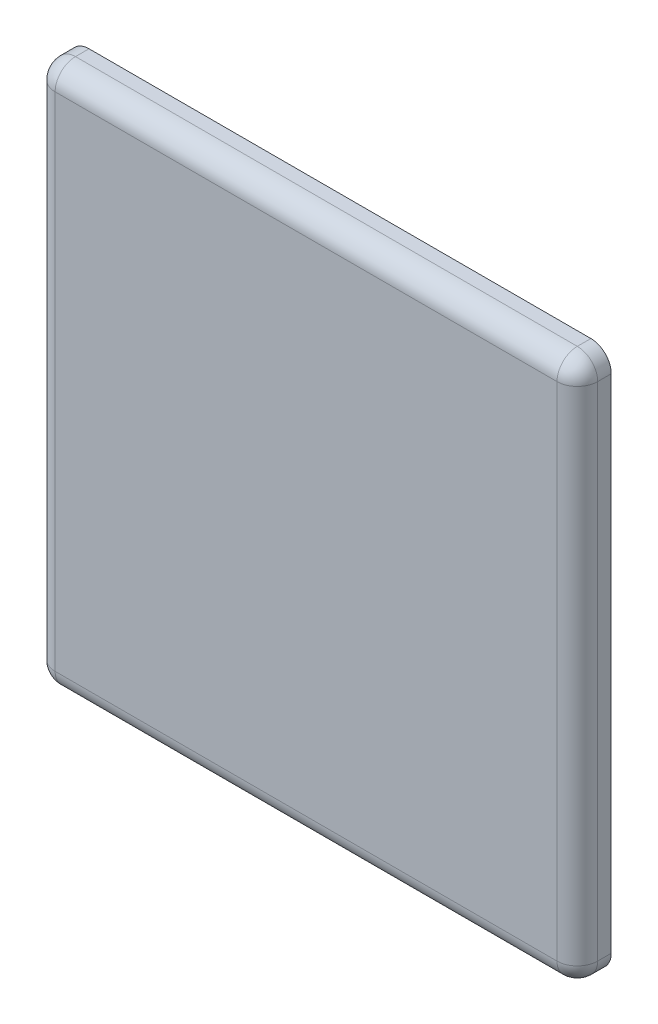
ISO-10303-21;
HEADER;
FILE_DESCRIPTION(('STEP AP214'),'2;1');
FILE_NAME('part.step','',(''),(''),'','','');
FILE_SCHEMA(('AUTOMOTIVE_DESIGN { 1 0 10303 214 1 1 1 1 }'));
ENDSEC;
DATA;
#1=APPLICATION_CONTEXT('core data for automotive mechanical design processes');
#2=APPLICATION_PROTOCOL_DEFINITION('international standard','automotive_design',2000,#1);
#3=PRODUCT_CONTEXT('',#1,'mechanical');
#4=PRODUCT('Part','Part','',(#3));
#5=PRODUCT_RELATED_PRODUCT_CATEGORY('part','',(#4));
#6=PRODUCT_DEFINITION_FORMATION('','',#4);
#7=PRODUCT_DEFINITION_CONTEXT('part definition',#1,'design');
#8=PRODUCT_DEFINITION('design','',#6,#7);
#9=PRODUCT_DEFINITION_SHAPE('','',#8);
#10=(LENGTH_UNIT() NAMED_UNIT(*) SI_UNIT(.MILLI.,.METRE.));
#11=(NAMED_UNIT(*) PLANE_ANGLE_UNIT() SI_UNIT($,.RADIAN.));
#12=(NAMED_UNIT(*) SI_UNIT($,.STERADIAN.) SOLID_ANGLE_UNIT());
#13=UNCERTAINTY_MEASURE_WITH_UNIT(LENGTH_MEASURE(1.E-05),#10,'distance_accuracy_value','');
#14=(GEOMETRIC_REPRESENTATION_CONTEXT(3) GLOBAL_UNCERTAINTY_ASSIGNED_CONTEXT((#13)) GLOBAL_UNIT_ASSIGNED_CONTEXT((#10,
#11,#12)) REPRESENTATION_CONTEXT('',''));
#15=CARTESIAN_POINT('',(0.,0.,0.));
#16=DIRECTION('',(0.,0.,1.));
#17=DIRECTION('',(1.,0.,0.));
#18=AXIS2_PLACEMENT_3D('',#15,#16,#17);
#19=CARTESIAN_POINT('',(1.5,38.5,1.));
#20=DIRECTION('',(0.,0.,1.));
#21=DIRECTION('',(0.,1.,0.));
#22=AXIS2_PLACEMENT_3D('',#19,#20,#21);
#23=SPHERICAL_SURFACE('',#22,1.5);
#24=CARTESIAN_POINT('',(1.5,38.5,1.));
#25=DIRECTION('',(-1.,0.,0.));
#26=DIRECTION('',(0.,0.,1.));
#27=AXIS2_PLACEMENT_3D('',#24,#25,#26);
#28=CIRCLE('',#27,1.5);
#29=CARTESIAN_POINT('',(1.5,40.,1.));
#30=VERTEX_POINT('',#29);
#31=CARTESIAN_POINT('',(1.5,38.5,2.5));
#32=VERTEX_POINT('',#31);
#33=EDGE_CURVE('E20',#30,#32,#28,.F.);
#34=ORIENTED_EDGE('',*,*,#33,.F.);
#35=CARTESIAN_POINT('',(1.5,38.5,1.));
#36=DIRECTION('',(0.,0.,-1.));
#37=DIRECTION('',(-1.,0.,0.));
#38=AXIS2_PLACEMENT_3D('',#35,#36,#37);
#39=CIRCLE('',#38,1.5);
#40=CARTESIAN_POINT('',(0.,38.5,1.));
#41=VERTEX_POINT('',#40);
#42=EDGE_CURVE('E93',#41,#30,#39,.T.);
#43=ORIENTED_EDGE('',*,*,#42,.F.);
#44=CARTESIAN_POINT('',(1.5,38.5,1.));
#45=DIRECTION('',(0.,-1.,0.));
#46=DIRECTION('',(0.,0.,-1.));
#47=AXIS2_PLACEMENT_3D('',#44,#45,#46);
#48=CIRCLE('',#47,1.5);
#49=EDGE_CURVE('E95',#32,#41,#48,.T.);
#50=ORIENTED_EDGE('',*,*,#49,.F.);
#51=EDGE_LOOP('',(#34,#43,#50));
#52=FACE_BOUND('',#51,.T.);
#53=ADVANCED_FACE('F16',(#52),#23,.T.);
#54=CARTESIAN_POINT('',(38.5,38.5,1.));
#55=DIRECTION('',(-1.,0.,0.));
#56=DIRECTION('',(0.,0.,1.));
#57=AXIS2_PLACEMENT_3D('',#54,#55,#56);
#58=CYLINDRICAL_SURFACE('',#57,1.5);
#59=CARTESIAN_POINT('',(38.5,38.5,1.));
#60=DIRECTION('',(1.,0.,0.));
#61=DIRECTION('',(0.,1.,0.));
#62=AXIS2_PLACEMENT_3D('',#59,#60,#61);
#63=CIRCLE('',#62,1.5);
#64=CARTESIAN_POINT('',(38.5,40.,1.));
#65=VERTEX_POINT('',#64);
#66=CARTESIAN_POINT('',(38.5,38.5,2.5));
#67=VERTEX_POINT('',#66);
#68=EDGE_CURVE('E111',#65,#67,#63,.T.);
#69=ORIENTED_EDGE('',*,*,#68,.F.);
#70=DIRECTION('',(1.,0.,0.));
#71=VECTOR('',#70,1.);
#72=CARTESIAN_POINT('',(20.,40.,1.));
#73=LINE('',#72,#71);
#74=EDGE_CURVE('E108',#30,#65,#73,.T.);
#75=ORIENTED_EDGE('',*,*,#74,.F.);
#76=ORIENTED_EDGE('',*,*,#33,.T.);
#77=DIRECTION('',(-1.,0.,0.));
#78=VECTOR('',#77,1.);
#79=CARTESIAN_POINT('',(20.,38.5,2.5));
#80=LINE('',#79,#78);
#81=EDGE_CURVE('E170',#67,#32,#80,.T.);
#82=ORIENTED_EDGE('',*,*,#81,.F.);
#83=EDGE_LOOP('',(#69,#75,#76,#82));
#84=FACE_BOUND('',#83,.T.);
#85=ADVANCED_FACE('F109',(#84),#58,.T.);
#86=CARTESIAN_POINT('',(1.5,38.5,1.));
#87=DIRECTION('',(0.,-1.,0.));
#88=DIRECTION('',(0.,0.,-1.));
#89=AXIS2_PLACEMENT_3D('',#86,#87,#88);
#90=CYLINDRICAL_SURFACE('',#89,1.5);
#91=CARTESIAN_POINT('',(1.5,1.5,1.));
#92=DIRECTION('',(0.,1.,0.));
#93=DIRECTION('',(0.,0.,1.));
#94=AXIS2_PLACEMENT_3D('',#91,#92,#93);
#95=CIRCLE('',#94,1.5);
#96=CARTESIAN_POINT('',(1.5,1.5,2.5));
#97=VERTEX_POINT('',#96);
#98=CARTESIAN_POINT('',(0.,1.5,1.));
#99=VERTEX_POINT('',#98);
#100=EDGE_CURVE('E163',#97,#99,#95,.F.);
#101=ORIENTED_EDGE('',*,*,#100,.F.);
#102=DIRECTION('',(0.,-1.,0.));
#103=VECTOR('',#102,1.);
#104=CARTESIAN_POINT('',(1.5,20.,2.5));
#105=LINE('',#104,#103);
#106=EDGE_CURVE('E166',#32,#97,#105,.T.);
#107=ORIENTED_EDGE('',*,*,#106,.F.);
#108=ORIENTED_EDGE('',*,*,#49,.T.);
#109=DIRECTION('',(0.,1.,0.));
#110=VECTOR('',#109,1.);
#111=CARTESIAN_POINT('',(0.,20.,1.));
#112=LINE('',#111,#110);
#113=EDGE_CURVE('E127',#99,#41,#112,.T.);
#114=ORIENTED_EDGE('',*,*,#113,.F.);
#115=EDGE_LOOP('',(#101,#107,#108,#114));
#116=FACE_BOUND('',#115,.T.);
#117=ADVANCED_FACE('F172',(#116),#90,.T.);
#118=CARTESIAN_POINT('',(1.5,1.5,1.));
#119=DIRECTION('',(0.,0.,-1.));
#120=DIRECTION('',(-1.,0.,0.));
#121=AXIS2_PLACEMENT_3D('',#118,#119,#120);
#122=CYLINDRICAL_SURFACE('',#121,1.5);
#123=DIRECTION('',(0.,0.,1.));
#124=VECTOR('',#123,1.);
#125=CARTESIAN_POINT('',(0.,1.5,0.5));
#126=LINE('',#125,#124);
#127=CARTESIAN_POINT('',(0.,1.5,0.));
#128=VERTEX_POINT('',#127);
#129=EDGE_CURVE('E125',#128,#99,#126,.T.);
#130=ORIENTED_EDGE('',*,*,#129,.F.);
#131=CARTESIAN_POINT('',(1.5,1.5,0.));
#132=DIRECTION('',(0.,0.,-1.));
#133=DIRECTION('',(-1.,0.,0.));
#134=AXIS2_PLACEMENT_3D('',#131,#132,#133);
#135=CIRCLE('',#134,1.5);
#136=CARTESIAN_POINT('',(1.5,0.,0.));
#137=VERTEX_POINT('',#136);
#138=EDGE_CURVE('E156',#137,#128,#135,.T.);
#139=ORIENTED_EDGE('',*,*,#138,.F.);
#140=DIRECTION('',(0.,0.,-1.));
#141=VECTOR('',#140,1.);
#142=CARTESIAN_POINT('',(1.5,0.,0.5));
#143=LINE('',#142,#141);
#144=CARTESIAN_POINT('',(1.5,0.,1.));
#145=VERTEX_POINT('',#144);
#146=EDGE_CURVE('E184',#145,#137,#143,.T.);
#147=ORIENTED_EDGE('',*,*,#146,.F.);
#148=CARTESIAN_POINT('',(1.5,1.5,1.));
#149=DIRECTION('',(0.,0.,1.));
#150=DIRECTION('',(1.,0.,0.));
#151=AXIS2_PLACEMENT_3D('',#148,#149,#150);
#152=CIRCLE('',#151,1.5);
#153=EDGE_CURVE('E160',#99,#145,#152,.T.);
#154=ORIENTED_EDGE('',*,*,#153,.F.);
#155=EDGE_LOOP('',(#130,#139,#147,#154));
#156=FACE_BOUND('',#155,.T.);
#157=ADVANCED_FACE('F182',(#156),#122,.T.);
#158=CARTESIAN_POINT('',(0.,1.5,0.));
#159=DIRECTION('',(-1.,0.,0.));
#160=DIRECTION('',(0.,0.,1.));
#161=AXIS2_PLACEMENT_3D('',#158,#159,#160);
#162=PLANE('',#161);
#163=ORIENTED_EDGE('',*,*,#129,.T.);
#164=ORIENTED_EDGE('',*,*,#113,.T.);
#165=DIRECTION('',(0.,0.,1.));
#166=VECTOR('',#165,1.);
#167=CARTESIAN_POINT('',(0.,38.5,0.5));
#168=LINE('',#167,#166);
#169=CARTESIAN_POINT('',(0.,38.5,0.));
#170=VERTEX_POINT('',#169);
#171=EDGE_CURVE('E105',#170,#41,#168,.T.);
#172=ORIENTED_EDGE('',*,*,#171,.F.);
#173=DIRECTION('',(0.,1.,0.));
#174=VECTOR('',#173,1.);
#175=CARTESIAN_POINT('',(0.,20.,0.));
#176=LINE('',#175,#174);
#177=EDGE_CURVE('E155',#128,#170,#176,.T.);
#178=ORIENTED_EDGE('',*,*,#177,.F.);
#179=EDGE_LOOP('',(#163,#164,#172,#178));
#180=FACE_BOUND('',#179,.T.);
#181=ADVANCED_FACE('F176',(#180),#162,.T.);
#182=CARTESIAN_POINT('',(1.5,38.5,1.));
#183=DIRECTION('',(0.,0.,-1.));
#184=DIRECTION('',(-1.,0.,0.));
#185=AXIS2_PLACEMENT_3D('',#182,#183,#184);
#186=CYLINDRICAL_SURFACE('',#185,1.5);
#187=DIRECTION('',(0.,0.,1.));
#188=VECTOR('',#187,1.);
#189=CARTESIAN_POINT('',(1.5,40.,0.5));
#190=LINE('',#189,#188);
#191=CARTESIAN_POINT('',(1.5,40.,0.));
#192=VERTEX_POINT('',#191);
#193=EDGE_CURVE('E103',#192,#30,#190,.T.);
#194=ORIENTED_EDGE('',*,*,#193,.F.);
#195=CARTESIAN_POINT('',(1.5,38.5,0.));
#196=DIRECTION('',(0.,0.,-1.));
#197=DIRECTION('',(-1.,0.,0.));
#198=AXIS2_PLACEMENT_3D('',#195,#196,#197);
#199=CIRCLE('',#198,1.5);
#200=EDGE_CURVE('E153',#170,#192,#199,.T.);
#201=ORIENTED_EDGE('',*,*,#200,.F.);
#202=ORIENTED_EDGE('',*,*,#171,.T.);
#203=ORIENTED_EDGE('',*,*,#42,.T.);
#204=EDGE_LOOP('',(#194,#201,#202,#203));
#205=FACE_BOUND('',#204,.T.);
#206=ADVANCED_FACE('F100',(#205),#186,.T.);
#207=CARTESIAN_POINT('',(1.5,40.,0.));
#208=DIRECTION('',(0.,1.,0.));
#209=DIRECTION('',(0.,0.,1.));
#210=AXIS2_PLACEMENT_3D('',#207,#208,#209);
#211=PLANE('',#210);
#212=DIRECTION('',(0.,0.,1.));
#213=VECTOR('',#212,1.);
#214=CARTESIAN_POINT('',(38.5,40.,0.5));
#215=LINE('',#214,#213);
#216=CARTESIAN_POINT('',(38.5,40.,0.));
#217=VERTEX_POINT('',#216);
#218=EDGE_CURVE('E114',#217,#65,#215,.T.);
#219=ORIENTED_EDGE('',*,*,#218,.F.);
#220=DIRECTION('',(1.,0.,0.));
#221=VECTOR('',#220,1.);
#222=CARTESIAN_POINT('',(20.,40.,0.));
#223=LINE('',#222,#221);
#224=EDGE_CURVE('E118',#192,#217,#223,.T.);
#225=ORIENTED_EDGE('',*,*,#224,.F.);
#226=ORIENTED_EDGE('',*,*,#193,.T.);
#227=ORIENTED_EDGE('',*,*,#74,.T.);
#228=EDGE_LOOP('',(#219,#225,#226,#227));
#229=FACE_BOUND('',#228,.T.);
#230=ADVANCED_FACE('F116',(#229),#211,.T.);
#231=CARTESIAN_POINT('',(38.5,38.5,1.));
#232=DIRECTION('',(0.,0.,-1.));
#233=DIRECTION('',(-1.,0.,0.));
#234=AXIS2_PLACEMENT_3D('',#231,#232,#233);
#235=CYLINDRICAL_SURFACE('',#234,1.5);
#236=DIRECTION('',(0.,0.,1.));
#237=VECTOR('',#236,1.);
#238=CARTESIAN_POINT('',(40.,38.5,0.5));
#239=LINE('',#238,#237);
#240=CARTESIAN_POINT('',(40.,38.5,0.));
#241=VERTEX_POINT('',#240);
#242=CARTESIAN_POINT('',(40.,38.5,1.));
#243=VERTEX_POINT('',#242);
#244=EDGE_CURVE('E123',#241,#243,#239,.T.);
#245=ORIENTED_EDGE('',*,*,#244,.F.);
#246=CARTESIAN_POINT('',(38.5,38.5,0.));
#247=DIRECTION('',(0.,0.,-1.));
#248=DIRECTION('',(-1.,0.,0.));
#249=AXIS2_PLACEMENT_3D('',#246,#247,#248);
#250=CIRCLE('',#249,1.5);
#251=EDGE_CURVE('E149',#217,#241,#250,.T.);
#252=ORIENTED_EDGE('',*,*,#251,.F.);
#253=ORIENTED_EDGE('',*,*,#218,.T.);
#254=CARTESIAN_POINT('',(38.5,38.5,1.));
#255=DIRECTION('',(0.,0.,1.));
#256=DIRECTION('',(1.,0.,0.));
#257=AXIS2_PLACEMENT_3D('',#254,#255,#256);
#258=CIRCLE('',#257,1.5);
#259=EDGE_CURVE('E167',#243,#65,#258,.T.);
#260=ORIENTED_EDGE('',*,*,#259,.F.);
#261=EDGE_LOOP('',(#245,#252,#253,#260));
#262=FACE_BOUND('',#261,.T.);
#263=ADVANCED_FACE('F249',(#262),#235,.T.);
#264=CARTESIAN_POINT('',(40.,1.5,1.));
#265=DIRECTION('',(1.,0.,0.));
#266=DIRECTION('',(0.,0.,-1.));
#267=AXIS2_PLACEMENT_3D('',#264,#265,#266);
#268=PLANE('',#267);
#269=ORIENTED_EDGE('',*,*,#244,.T.);
#270=DIRECTION('',(0.,1.,0.));
#271=VECTOR('',#270,1.);
#272=CARTESIAN_POINT('',(40.,20.,1.));
#273=LINE('',#272,#271);
#274=CARTESIAN_POINT('',(40.,1.5,1.));
#275=VERTEX_POINT('',#274);
#276=EDGE_CURVE('E148',#275,#243,#273,.T.);
#277=ORIENTED_EDGE('',*,*,#276,.F.);
#278=DIRECTION('',(0.,0.,-1.));
#279=VECTOR('',#278,1.);
#280=CARTESIAN_POINT('',(40.,1.5,0.5));
#281=LINE('',#280,#279);
#282=CARTESIAN_POINT('',(40.,1.5,0.));
#283=VERTEX_POINT('',#282);
#284=EDGE_CURVE('E205',#275,#283,#281,.T.);
#285=ORIENTED_EDGE('',*,*,#284,.T.);
#286=DIRECTION('',(0.,-1.,0.));
#287=VECTOR('',#286,1.);
#288=CARTESIAN_POINT('',(40.,20.,0.));
#289=LINE('',#288,#287);
#290=EDGE_CURVE('E152',#241,#283,#289,.T.);
#291=ORIENTED_EDGE('',*,*,#290,.F.);
#292=EDGE_LOOP('',(#269,#277,#285,#291));
#293=FACE_BOUND('',#292,.T.);
#294=ADVANCED_FACE('F224',(#293),#268,.T.);
#295=CARTESIAN_POINT('',(38.5,38.5,1.));
#296=DIRECTION('',(0.,0.,1.));
#297=DIRECTION('',(1.,0.,0.));
#298=AXIS2_PLACEMENT_3D('',#295,#296,#297);
#299=SPHERICAL_SURFACE('',#298,1.5);
#300=CARTESIAN_POINT('',(38.5,38.5,1.));
#301=DIRECTION('',(0.,-1.,0.));
#302=DIRECTION('',(0.,0.,-1.));
#303=AXIS2_PLACEMENT_3D('',#300,#301,#302);
#304=CIRCLE('',#303,1.5);
#305=EDGE_CURVE('E144',#243,#67,#304,.T.);
#306=ORIENTED_EDGE('',*,*,#305,.F.);
#307=ORIENTED_EDGE('',*,*,#259,.T.);
#308=ORIENTED_EDGE('',*,*,#68,.T.);
#309=EDGE_LOOP('',(#306,#307,#308));
#310=FACE_BOUND('',#309,.T.);
#311=ADVANCED_FACE('F226',(#310),#299,.T.);
#312=CARTESIAN_POINT('',(1.5,1.5,2.5));
#313=DIRECTION('',(0.,0.,1.));
#314=DIRECTION('',(1.,0.,0.));
#315=AXIS2_PLACEMENT_3D('',#312,#313,#314);
#316=PLANE('',#315);
#317=ORIENTED_EDGE('',*,*,#81,.T.);
#318=ORIENTED_EDGE('',*,*,#106,.T.);
#319=DIRECTION('',(-1.,0.,0.));
#320=VECTOR('',#319,1.);
#321=CARTESIAN_POINT('',(20.,1.5,2.5));
#322=LINE('',#321,#320);
#323=CARTESIAN_POINT('',(38.5,1.5,2.5));
#324=VERTEX_POINT('',#323);
#325=EDGE_CURVE('E143',#324,#97,#322,.T.);
#326=ORIENTED_EDGE('',*,*,#325,.F.);
#327=DIRECTION('',(0.,-1.,0.));
#328=VECTOR('',#327,1.);
#329=CARTESIAN_POINT('',(38.5,20.,2.5));
#330=LINE('',#329,#328);
#331=EDGE_CURVE('E147',#67,#324,#330,.T.);
#332=ORIENTED_EDGE('',*,*,#331,.F.);
#333=EDGE_LOOP('',(#317,#318,#326,#332));
#334=FACE_BOUND('',#333,.T.);
#335=ADVANCED_FACE('F227',(#334),#316,.T.);
#336=CARTESIAN_POINT('',(1.5,1.5,1.));
#337=DIRECTION('',(0.,0.,1.));
#338=DIRECTION('',(-1.,0.,0.));
#339=AXIS2_PLACEMENT_3D('',#336,#337,#338);
#340=SPHERICAL_SURFACE('',#339,1.5);
#341=ORIENTED_EDGE('',*,*,#100,.T.);
#342=ORIENTED_EDGE('',*,*,#153,.T.);
#343=CARTESIAN_POINT('',(1.5,1.5,1.));
#344=DIRECTION('',(-1.,0.,0.));
#345=DIRECTION('',(0.,0.,1.));
#346=AXIS2_PLACEMENT_3D('',#343,#344,#345);
#347=CIRCLE('',#346,1.5);
#348=EDGE_CURVE('E140',#97,#145,#347,.F.);
#349=ORIENTED_EDGE('',*,*,#348,.F.);
#350=EDGE_LOOP('',(#341,#342,#349));
#351=FACE_BOUND('',#350,.T.);
#352=ADVANCED_FACE('F187',(#351),#340,.T.);
#353=CARTESIAN_POINT('',(1.5,0.,1.));
#354=DIRECTION('',(0.,-1.,0.));
#355=DIRECTION('',(0.,0.,-1.));
#356=AXIS2_PLACEMENT_3D('',#353,#354,#355);
#357=PLANE('',#356);
#358=ORIENTED_EDGE('',*,*,#146,.T.);
#359=DIRECTION('',(-1.,0.,0.));
#360=VECTOR('',#359,1.);
#361=CARTESIAN_POINT('',(20.,0.,0.));
#362=LINE('',#361,#360);
#363=CARTESIAN_POINT('',(38.5,0.,0.));
#364=VERTEX_POINT('',#363);
#365=EDGE_CURVE('E159',#364,#137,#362,.T.);
#366=ORIENTED_EDGE('',*,*,#365,.F.);
#367=DIRECTION('',(0.,0.,1.));
#368=VECTOR('',#367,1.);
#369=CARTESIAN_POINT('',(38.5,0.,0.5));
#370=LINE('',#369,#368);
#371=CARTESIAN_POINT('',(38.5,0.,1.));
#372=VERTEX_POINT('',#371);
#373=EDGE_CURVE('E35',#364,#372,#370,.T.);
#374=ORIENTED_EDGE('',*,*,#373,.T.);
#375=DIRECTION('',(1.,0.,0.));
#376=VECTOR('',#375,1.);
#377=CARTESIAN_POINT('',(20.,0.,1.));
#378=LINE('',#377,#376);
#379=EDGE_CURVE('E139',#145,#372,#378,.T.);
#380=ORIENTED_EDGE('',*,*,#379,.F.);
#381=EDGE_LOOP('',(#358,#366,#374,#380));
#382=FACE_BOUND('',#381,.T.);
#383=ADVANCED_FACE('F189',(#382),#357,.T.);
#384=CARTESIAN_POINT('',(40.,0.,0.));
#385=DIRECTION('',(0.,0.,-1.));
#386=DIRECTION('',(-1.,0.,0.));
#387=AXIS2_PLACEMENT_3D('',#384,#385,#386);
#388=PLANE('',#387);
#389=ORIENTED_EDGE('',*,*,#251,.T.);
#390=ORIENTED_EDGE('',*,*,#290,.T.);
#391=CARTESIAN_POINT('',(38.5,1.5,0.));
#392=DIRECTION('',(0.,0.,-1.));
#393=DIRECTION('',(-1.,0.,0.));
#394=AXIS2_PLACEMENT_3D('',#391,#392,#393);
#395=CIRCLE('',#394,1.5);
#396=EDGE_CURVE('E136',#364,#283,#395,.F.);
#397=ORIENTED_EDGE('',*,*,#396,.F.);
#398=ORIENTED_EDGE('',*,*,#365,.T.);
#399=ORIENTED_EDGE('',*,*,#138,.T.);
#400=ORIENTED_EDGE('',*,*,#177,.T.);
#401=ORIENTED_EDGE('',*,*,#200,.T.);
#402=ORIENTED_EDGE('',*,*,#224,.T.);
#403=EDGE_LOOP('',(#389,#390,#397,#398,#399,#400,#401,#402));
#404=FACE_BOUND('',#403,.T.);
#405=ADVANCED_FACE('F248',(#404),#388,.T.);
#406=CARTESIAN_POINT('',(38.5,38.5,1.));
#407=DIRECTION('',(0.,-1.,0.));
#408=DIRECTION('',(0.,0.,-1.));
#409=AXIS2_PLACEMENT_3D('',#406,#407,#408);
#410=CYLINDRICAL_SURFACE('',#409,1.5);
#411=ORIENTED_EDGE('',*,*,#305,.T.);
#412=ORIENTED_EDGE('',*,*,#331,.T.);
#413=CARTESIAN_POINT('',(38.5,1.5,1.));
#414=DIRECTION('',(0.,-1.,0.));
#415=DIRECTION('',(1.,0.,0.));
#416=AXIS2_PLACEMENT_3D('',#413,#414,#415);
#417=CIRCLE('',#416,1.5);
#418=EDGE_CURVE('E133',#275,#324,#417,.T.);
#419=ORIENTED_EDGE('',*,*,#418,.F.);
#420=ORIENTED_EDGE('',*,*,#276,.T.);
#421=EDGE_LOOP('',(#411,#412,#419,#420));
#422=FACE_BOUND('',#421,.T.);
#423=ADVANCED_FACE('F222',(#422),#410,.T.);
#424=CARTESIAN_POINT('',(38.5,1.5,1.));
#425=DIRECTION('',(-1.,0.,0.));
#426=DIRECTION('',(0.,0.,1.));
#427=AXIS2_PLACEMENT_3D('',#424,#425,#426);
#428=CYLINDRICAL_SURFACE('',#427,1.5);
#429=ORIENTED_EDGE('',*,*,#348,.T.);
#430=ORIENTED_EDGE('',*,*,#379,.T.);
#431=CARTESIAN_POINT('',(38.5,1.5,1.));
#432=DIRECTION('',(-1.,0.,0.));
#433=DIRECTION('',(0.,0.,1.));
#434=AXIS2_PLACEMENT_3D('',#431,#432,#433);
#435=CIRCLE('',#434,1.5);
#436=EDGE_CURVE('E26',#324,#372,#435,.F.);
#437=ORIENTED_EDGE('',*,*,#436,.F.);
#438=ORIENTED_EDGE('',*,*,#325,.T.);
#439=EDGE_LOOP('',(#429,#430,#437,#438));
#440=FACE_BOUND('',#439,.T.);
#441=ADVANCED_FACE('F194',(#440),#428,.T.);
#442=CARTESIAN_POINT('',(38.5,1.5,1.));
#443=DIRECTION('',(0.,0.,-1.));
#444=DIRECTION('',(-1.,0.,0.));
#445=AXIS2_PLACEMENT_3D('',#442,#443,#444);
#446=CYLINDRICAL_SURFACE('',#445,1.5);
#447=ORIENTED_EDGE('',*,*,#373,.F.);
#448=ORIENTED_EDGE('',*,*,#396,.T.);
#449=ORIENTED_EDGE('',*,*,#284,.F.);
#450=CARTESIAN_POINT('',(38.5,1.5,1.));
#451=DIRECTION('',(0.,0.,1.));
#452=DIRECTION('',(1.,0.,0.));
#453=AXIS2_PLACEMENT_3D('',#450,#451,#452);
#454=CIRCLE('',#453,1.5);
#455=EDGE_CURVE('E10',#372,#275,#454,.T.);
#456=ORIENTED_EDGE('',*,*,#455,.F.);
#457=EDGE_LOOP('',(#447,#448,#449,#456));
#458=FACE_BOUND('',#457,.T.);
#459=ADVANCED_FACE('F239',(#458),#446,.T.);
#460=CARTESIAN_POINT('',(38.5,1.5,1.));
#461=DIRECTION('',(0.,0.,1.));
#462=DIRECTION('',(0.,-1.,0.));
#463=AXIS2_PLACEMENT_3D('',#460,#461,#462);
#464=SPHERICAL_SURFACE('',#463,1.5);
#465=ORIENTED_EDGE('',*,*,#436,.T.);
#466=ORIENTED_EDGE('',*,*,#455,.T.);
#467=ORIENTED_EDGE('',*,*,#418,.T.);
#468=EDGE_LOOP('',(#465,#466,#467));
#469=FACE_BOUND('',#468,.T.);
#470=ADVANCED_FACE('F18',(#469),#464,.T.);
#471=CLOSED_SHELL('',(#53,#85,#117,#157,#181,#206,#230,#263,#294,#311,#335,#352,#383,#405,#423,
#441,#459,#470));
#472=MANIFOLD_SOLID_BREP('B1',#471);
#473=ADVANCED_BREP_SHAPE_REPRESENTATION('',(#18,#472),#14);
#474=SHAPE_DEFINITION_REPRESENTATION(#9,#473);
ENDSEC;
END-ISO-10303-21;
